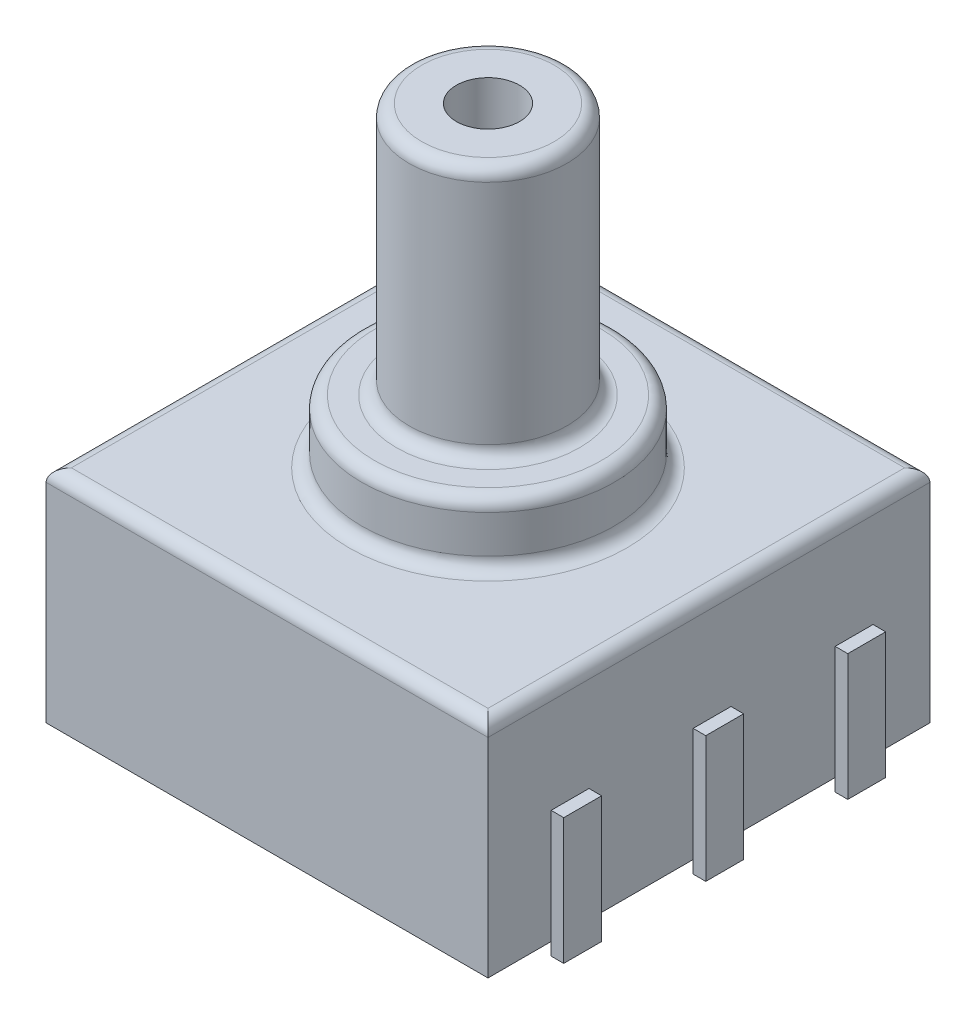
ISO-10303-21;
HEADER;
FILE_DESCRIPTION(('STEP AP214'),'2;1');
FILE_NAME('part.step','',(''),(''),'','','');
FILE_SCHEMA(('AUTOMOTIVE_DESIGN { 1 0 10303 214 1 1 1 1 }'));
ENDSEC;
DATA;
#1=APPLICATION_CONTEXT('core data for automotive mechanical design processes');
#2=APPLICATION_PROTOCOL_DEFINITION('international standard','automotive_design',2000,#1);
#3=PRODUCT_CONTEXT('',#1,'mechanical');
#4=PRODUCT('Part','Part','',(#3));
#5=PRODUCT_RELATED_PRODUCT_CATEGORY('part','',(#4));
#6=PRODUCT_DEFINITION_FORMATION('','',#4);
#7=PRODUCT_DEFINITION_CONTEXT('part definition',#1,'design');
#8=PRODUCT_DEFINITION('design','',#6,#7);
#9=PRODUCT_DEFINITION_SHAPE('','',#8);
#10=(LENGTH_UNIT() NAMED_UNIT(*) SI_UNIT(.MILLI.,.METRE.));
#11=(NAMED_UNIT(*) PLANE_ANGLE_UNIT() SI_UNIT($,.RADIAN.));
#12=(NAMED_UNIT(*) SI_UNIT($,.STERADIAN.) SOLID_ANGLE_UNIT());
#13=UNCERTAINTY_MEASURE_WITH_UNIT(LENGTH_MEASURE(1.E-05),#10,'distance_accuracy_value','');
#14=(GEOMETRIC_REPRESENTATION_CONTEXT(3) GLOBAL_UNCERTAINTY_ASSIGNED_CONTEXT((#13)) GLOBAL_UNIT_ASSIGNED_CONTEXT((#10,
#11,#12)) REPRESENTATION_CONTEXT('',''));
#15=CARTESIAN_POINT('',(0.,0.,0.));
#16=DIRECTION('',(0.,0.,1.));
#17=DIRECTION('',(1.,0.,0.));
#18=AXIS2_PLACEMENT_3D('',#15,#16,#17);
#19=CARTESIAN_POINT('',(3.5,3.5,-3.5));
#20=DIRECTION('',(-1.,0.,0.));
#21=DIRECTION('',(0.,0.,1.));
#22=AXIS2_PLACEMENT_3D('',#19,#20,#21);
#23=PLANE('',#22);
#24=DIRECTION('',(0.,-1.,0.));
#25=VECTOR('',#24,1.);
#26=CARTESIAN_POINT('',(3.5,1.8,-2.));
#27=LINE('',#26,#25);
#28=CARTESIAN_POINT('',(3.5,1.8,-2.));
#29=VERTEX_POINT('',#28);
#30=CARTESIAN_POINT('',(3.5,0.,-2.));
#31=VERTEX_POINT('',#30);
#32=EDGE_CURVE('E343',#29,#31,#27,.T.);
#33=ORIENTED_EDGE('',*,*,#32,.F.);
#34=DIRECTION('',(0.,0.,1.));
#35=VECTOR('',#34,1.);
#36=CARTESIAN_POINT('',(3.5,1.8,-2.));
#37=LINE('',#36,#35);
#38=CARTESIAN_POINT('',(3.5,1.8,-2.6));
#39=VERTEX_POINT('',#38);
#40=EDGE_CURVE('E352',#39,#29,#37,.T.);
#41=ORIENTED_EDGE('',*,*,#40,.F.);
#42=DIRECTION('',(0.,1.,0.));
#43=VECTOR('',#42,1.);
#44=CARTESIAN_POINT('',(3.5,1.8,-2.6));
#45=LINE('',#44,#43);
#46=CARTESIAN_POINT('',(3.5,0.,-2.6));
#47=VERTEX_POINT('',#46);
#48=EDGE_CURVE('E348',#47,#39,#45,.T.);
#49=ORIENTED_EDGE('',*,*,#48,.F.);
#50=DIRECTION('',(0.,0.,-1.));
#51=VECTOR('',#50,1.);
#52=CARTESIAN_POINT('',(3.5,0.,-3.5));
#53=LINE('',#52,#51);
#54=CARTESIAN_POINT('',(3.5,0.,-3.5));
#55=VERTEX_POINT('',#54);
#56=EDGE_CURVE('E508',#47,#55,#53,.T.);
#57=ORIENTED_EDGE('',*,*,#56,.T.);
#58=DIRECTION('',(0.,-1.,0.));
#59=VECTOR('',#58,1.);
#60=CARTESIAN_POINT('',(3.5,3.5,-3.5));
#61=LINE('',#60,#59);
#62=CARTESIAN_POINT('',(3.5,3.3,-3.5));
#63=VERTEX_POINT('',#62);
#64=EDGE_CURVE('E518',#63,#55,#61,.T.);
#65=ORIENTED_EDGE('',*,*,#64,.F.);
#66=DIRECTION('',(0.,0.,-1.));
#67=VECTOR('',#66,1.);
#68=CARTESIAN_POINT('',(3.50000000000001,3.3,3.5));
#69=LINE('',#68,#67);
#70=CARTESIAN_POINT('',(3.50000000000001,3.3,3.5));
#71=VERTEX_POINT('',#70);
#72=EDGE_CURVE('E544',#63,#71,#69,.F.);
#73=ORIENTED_EDGE('',*,*,#72,.T.);
#74=DIRECTION('',(0.,-1.,0.));
#75=VECTOR('',#74,1.);
#76=CARTESIAN_POINT('',(3.50000000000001,3.5,3.5));
#77=LINE('',#76,#75);
#78=CARTESIAN_POINT('',(3.50000000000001,0.,3.5));
#79=VERTEX_POINT('',#78);
#80=EDGE_CURVE('E521',#71,#79,#77,.T.);
#81=ORIENTED_EDGE('',*,*,#80,.T.);
#82=CARTESIAN_POINT('',(3.5,0.,2.5));
#83=VERTEX_POINT('',#82);
#84=EDGE_CURVE('E509',#79,#83,#53,.T.);
#85=ORIENTED_EDGE('',*,*,#84,.T.);
#86=DIRECTION('',(0.,-1.,0.));
#87=VECTOR('',#86,1.);
#88=CARTESIAN_POINT('',(3.5,1.8,2.5));
#89=LINE('',#88,#87);
#90=CARTESIAN_POINT('',(3.5,1.8,2.5));
#91=VERTEX_POINT('',#90);
#92=EDGE_CURVE('E447',#91,#83,#89,.T.);
#93=ORIENTED_EDGE('',*,*,#92,.F.);
#94=DIRECTION('',(0.,0.,1.));
#95=VECTOR('',#94,1.);
#96=CARTESIAN_POINT('',(3.5,1.8,2.5));
#97=LINE('',#96,#95);
#98=CARTESIAN_POINT('',(3.5,1.8,1.9));
#99=VERTEX_POINT('',#98);
#100=EDGE_CURVE('E456',#99,#91,#97,.T.);
#101=ORIENTED_EDGE('',*,*,#100,.F.);
#102=DIRECTION('',(0.,1.,0.));
#103=VECTOR('',#102,1.);
#104=CARTESIAN_POINT('',(3.5,1.8,1.9));
#105=LINE('',#104,#103);
#106=CARTESIAN_POINT('',(3.5,0.,1.9));
#107=VERTEX_POINT('',#106);
#108=EDGE_CURVE('E452',#107,#99,#105,.T.);
#109=ORIENTED_EDGE('',*,*,#108,.F.);
#110=CARTESIAN_POINT('',(3.5,0.,0.249999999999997));
#111=VERTEX_POINT('',#110);
#112=EDGE_CURVE('E1109',#107,#111,#53,.T.);
#113=ORIENTED_EDGE('',*,*,#112,.T.);
#114=DIRECTION('',(0.,-1.,0.));
#115=VECTOR('',#114,1.);
#116=CARTESIAN_POINT('',(3.5,1.8,0.249999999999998));
#117=LINE('',#116,#115);
#118=CARTESIAN_POINT('',(3.5,1.8,0.249999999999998));
#119=VERTEX_POINT('',#118);
#120=EDGE_CURVE('E377',#119,#111,#117,.T.);
#121=ORIENTED_EDGE('',*,*,#120,.F.);
#122=DIRECTION('',(0.,0.,1.));
#123=VECTOR('',#122,1.);
#124=CARTESIAN_POINT('',(3.5,1.8,0.249999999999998));
#125=LINE('',#124,#123);
#126=CARTESIAN_POINT('',(3.5,1.8,-0.350000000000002));
#127=VERTEX_POINT('',#126);
#128=EDGE_CURVE('E386',#127,#119,#125,.T.);
#129=ORIENTED_EDGE('',*,*,#128,.F.);
#130=DIRECTION('',(0.,1.,0.));
#131=VECTOR('',#130,1.);
#132=CARTESIAN_POINT('',(3.5,1.8,-0.350000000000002));
#133=LINE('',#132,#131);
#134=CARTESIAN_POINT('',(3.5,0.,-0.350000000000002));
#135=VERTEX_POINT('',#134);
#136=EDGE_CURVE('E382',#135,#127,#133,.T.);
#137=ORIENTED_EDGE('',*,*,#136,.F.);
#138=EDGE_CURVE('E1125',#135,#31,#53,.T.);
#139=ORIENTED_EDGE('',*,*,#138,.T.);
#140=EDGE_LOOP('',(#33,#41,#49,#57,#65,#73,#81,#85,#93,#101,#109,#113,#121,#129,#137,#139));
#141=FACE_BOUND('',#140,.T.);
#142=ADVANCED_FACE('F33',(#141),#23,.F.);
#143=CARTESIAN_POINT('',(-3.5,3.5,3.5));
#144=DIRECTION('',(0.,1.,0.));
#145=DIRECTION('',(0.,0.,1.));
#146=AXIS2_PLACEMENT_3D('',#143,#144,#145);
#147=PLANE('',#146);
#148=DIRECTION('',(0.,0.,-1.));
#149=VECTOR('',#148,1.);
#150=CARTESIAN_POINT('',(3.3,3.5,-3.5));
#151=LINE('',#150,#149);
#152=CARTESIAN_POINT('',(3.3,3.5,3.3));
#153=VERTEX_POINT('',#152);
#154=CARTESIAN_POINT('',(3.3,3.5,-3.3));
#155=VERTEX_POINT('',#154);
#156=EDGE_CURVE('E536',#153,#155,#151,.T.);
#157=ORIENTED_EDGE('',*,*,#156,.T.);
#158=DIRECTION('',(-1.,0.,0.));
#159=VECTOR('',#158,1.);
#160=CARTESIAN_POINT('',(-3.5,3.5,-3.3));
#161=LINE('',#160,#159);
#162=CARTESIAN_POINT('',(-3.3,3.5,-3.3));
#163=VERTEX_POINT('',#162);
#164=EDGE_CURVE('E538',#155,#163,#161,.T.);
#165=ORIENTED_EDGE('',*,*,#164,.T.);
#166=DIRECTION('',(0.,0.,1.));
#167=VECTOR('',#166,1.);
#168=CARTESIAN_POINT('',(-3.3,3.5,3.5));
#169=LINE('',#168,#167);
#170=CARTESIAN_POINT('',(-3.3,3.5,3.3));
#171=VERTEX_POINT('',#170);
#172=EDGE_CURVE('E532',#163,#171,#169,.T.);
#173=ORIENTED_EDGE('',*,*,#172,.T.);
#174=DIRECTION('',(1.,0.,0.));
#175=VECTOR('',#174,1.);
#176=CARTESIAN_POINT('',(3.50000000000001,3.5,3.3));
#177=LINE('',#176,#175);
#178=EDGE_CURVE('E534',#171,#153,#177,.T.);
#179=ORIENTED_EDGE('',*,*,#178,.T.);
#180=EDGE_LOOP('',(#157,#165,#173,#179));
#181=FACE_BOUND('',#180,.T.);
#182=CARTESIAN_POINT('',(0.,3.5,0.));
#183=DIRECTION('',(0.,1.,0.));
#184=DIRECTION('',(0.,0.,1.));
#185=AXIS2_PLACEMENT_3D('',#182,#183,#184);
#186=CIRCLE('',#185,2.2);
#187=CARTESIAN_POINT('',(0.,3.5,2.2));
#188=VERTEX_POINT('',#187);
#189=EDGE_CURVE('E529',#188,#188,#186,.F.);
#190=ORIENTED_EDGE('',*,*,#189,.T.);
#191=EDGE_LOOP('',(#190));
#192=FACE_BOUND('',#191,.T.);
#193=ADVANCED_FACE('F582',(#181,#192),#147,.T.);
#194=CARTESIAN_POINT('',(-3.5,3.5,-3.5));
#195=DIRECTION('',(1.,0.,0.));
#196=DIRECTION('',(0.,0.,-1.));
#197=AXIS2_PLACEMENT_3D('',#194,#195,#196);
#198=PLANE('',#197);
#199=DIRECTION('',(0.,0.,1.));
#200=VECTOR('',#199,1.);
#201=CARTESIAN_POINT('',(-3.50000000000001,1.8,-2.));
#202=LINE('',#201,#200);
#203=CARTESIAN_POINT('',(-3.5,1.8,-2.6));
#204=VERTEX_POINT('',#203);
#205=CARTESIAN_POINT('',(-3.5,1.8,-2.));
#206=VERTEX_POINT('',#205);
#207=EDGE_CURVE('E48',#204,#206,#202,.T.);
#208=ORIENTED_EDGE('',*,*,#207,.T.);
#209=DIRECTION('',(0.,-1.,0.));
#210=VECTOR('',#209,1.);
#211=CARTESIAN_POINT('',(-3.50000000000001,1.8,-2.));
#212=LINE('',#211,#210);
#213=CARTESIAN_POINT('',(-3.50000000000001,0.,-2.));
#214=VERTEX_POINT('',#213);
#215=EDGE_CURVE('E1085',#206,#214,#212,.T.);
#216=ORIENTED_EDGE('',*,*,#215,.T.);
#217=DIRECTION('',(0.,0.,1.));
#218=VECTOR('',#217,1.);
#219=CARTESIAN_POINT('',(-3.5,0.,-3.5));
#220=LINE('',#219,#218);
#221=CARTESIAN_POINT('',(-3.5,0.,-0.350000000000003));
#222=VERTEX_POINT('',#221);
#223=EDGE_CURVE('E504',#214,#222,#220,.T.);
#224=ORIENTED_EDGE('',*,*,#223,.T.);
#225=DIRECTION('',(0.,1.,0.));
#226=VECTOR('',#225,1.);
#227=CARTESIAN_POINT('',(-3.50000000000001,1.8,-0.350000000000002));
#228=LINE('',#227,#226);
#229=CARTESIAN_POINT('',(-3.5,1.8,-0.350000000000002));
#230=VERTEX_POINT('',#229);
#231=EDGE_CURVE('E312',#222,#230,#228,.T.);
#232=ORIENTED_EDGE('',*,*,#231,.T.);
#233=DIRECTION('',(0.,0.,1.));
#234=VECTOR('',#233,1.);
#235=CARTESIAN_POINT('',(-3.50000000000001,1.8,0.249999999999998));
#236=LINE('',#235,#234);
#237=CARTESIAN_POINT('',(-3.5,1.8,0.249999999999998));
#238=VERTEX_POINT('',#237);
#239=EDGE_CURVE('E310',#230,#238,#236,.T.);
#240=ORIENTED_EDGE('',*,*,#239,.T.);
#241=DIRECTION('',(0.,-1.,0.));
#242=VECTOR('',#241,1.);
#243=CARTESIAN_POINT('',(-3.50000000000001,1.8,0.249999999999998));
#244=LINE('',#243,#242);
#245=CARTESIAN_POINT('',(-3.50000000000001,0.,0.249999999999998));
#246=VERTEX_POINT('',#245);
#247=EDGE_CURVE('E307',#238,#246,#244,.T.);
#248=ORIENTED_EDGE('',*,*,#247,.T.);
#249=CARTESIAN_POINT('',(-3.5,0.,1.9));
#250=VERTEX_POINT('',#249);
#251=EDGE_CURVE('E1088',#246,#250,#220,.T.);
#252=ORIENTED_EDGE('',*,*,#251,.T.);
#253=DIRECTION('',(0.,1.,0.));
#254=VECTOR('',#253,1.);
#255=CARTESIAN_POINT('',(-3.5,1.8,1.9));
#256=LINE('',#255,#254);
#257=CARTESIAN_POINT('',(-3.5,1.8,1.9));
#258=VERTEX_POINT('',#257);
#259=EDGE_CURVE('E416',#250,#258,#256,.T.);
#260=ORIENTED_EDGE('',*,*,#259,.T.);
#261=DIRECTION('',(0.,0.,1.));
#262=VECTOR('',#261,1.);
#263=CARTESIAN_POINT('',(-3.5,1.8,2.5));
#264=LINE('',#263,#262);
#265=CARTESIAN_POINT('',(-3.5,1.8,2.5));
#266=VERTEX_POINT('',#265);
#267=EDGE_CURVE('E414',#258,#266,#264,.T.);
#268=ORIENTED_EDGE('',*,*,#267,.T.);
#269=DIRECTION('',(0.,-1.,0.));
#270=VECTOR('',#269,1.);
#271=CARTESIAN_POINT('',(-3.5,1.8,2.5));
#272=LINE('',#271,#270);
#273=CARTESIAN_POINT('',(-3.5,0.,2.5));
#274=VERTEX_POINT('',#273);
#275=EDGE_CURVE('E411',#266,#274,#272,.T.);
#276=ORIENTED_EDGE('',*,*,#275,.T.);
#277=CARTESIAN_POINT('',(-3.5,0.,3.5));
#278=VERTEX_POINT('',#277);
#279=EDGE_CURVE('E499',#274,#278,#220,.T.);
#280=ORIENTED_EDGE('',*,*,#279,.T.);
#281=DIRECTION('',(0.,-1.,0.));
#282=VECTOR('',#281,1.);
#283=CARTESIAN_POINT('',(-3.5,3.5,3.5));
#284=LINE('',#283,#282);
#285=CARTESIAN_POINT('',(-3.5,3.3,3.5));
#286=VERTEX_POINT('',#285);
#287=EDGE_CURVE('E523',#286,#278,#284,.T.);
#288=ORIENTED_EDGE('',*,*,#287,.F.);
#289=DIRECTION('',(0.,0.,1.));
#290=VECTOR('',#289,1.);
#291=CARTESIAN_POINT('',(-3.5,3.3,-3.5));
#292=LINE('',#291,#290);
#293=CARTESIAN_POINT('',(-3.5,3.3,-3.5));
#294=VERTEX_POINT('',#293);
#295=EDGE_CURVE('E548',#286,#294,#292,.F.);
#296=ORIENTED_EDGE('',*,*,#295,.T.);
#297=DIRECTION('',(0.,-1.,0.));
#298=VECTOR('',#297,1.);
#299=CARTESIAN_POINT('',(-3.5,3.5,-3.5));
#300=LINE('',#299,#298);
#301=CARTESIAN_POINT('',(-3.5,0.,-3.5));
#302=VERTEX_POINT('',#301);
#303=EDGE_CURVE('E516',#294,#302,#300,.T.);
#304=ORIENTED_EDGE('',*,*,#303,.T.);
#305=CARTESIAN_POINT('',(-3.5,0.,-2.6));
#306=VERTEX_POINT('',#305);
#307=EDGE_CURVE('E500',#302,#306,#220,.T.);
#308=ORIENTED_EDGE('',*,*,#307,.T.);
#309=DIRECTION('',(0.,1.,0.));
#310=VECTOR('',#309,1.);
#311=CARTESIAN_POINT('',(-3.50000000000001,1.8,-2.6));
#312=LINE('',#311,#310);
#313=EDGE_CURVE('E53',#306,#204,#312,.T.);
#314=ORIENTED_EDGE('',*,*,#313,.T.);
#315=EDGE_LOOP('',(#208,#216,#224,#232,#240,#248,#252,#260,#268,#276,#280,#288,#296,#304,#308,#314));
#316=FACE_BOUND('',#315,.T.);
#317=ADVANCED_FACE('F35',(#316),#198,.F.);
#318=CARTESIAN_POINT('',(-3.5,3.5,3.5));
#319=DIRECTION('',(0.,0.,-1.));
#320=DIRECTION('',(-1.,0.,0.));
#321=AXIS2_PLACEMENT_3D('',#318,#319,#320);
#322=PLANE('',#321);
#323=ORIENTED_EDGE('',*,*,#80,.F.);
#324=DIRECTION('',(1.,0.,0.));
#325=VECTOR('',#324,1.);
#326=CARTESIAN_POINT('',(-3.5,3.3,3.5));
#327=LINE('',#326,#325);
#328=EDGE_CURVE('E546',#71,#286,#327,.F.);
#329=ORIENTED_EDGE('',*,*,#328,.T.);
#330=ORIENTED_EDGE('',*,*,#287,.T.);
#331=DIRECTION('',(1.,0.,0.));
#332=VECTOR('',#331,1.);
#333=CARTESIAN_POINT('',(-3.5,0.,3.5));
#334=LINE('',#333,#332);
#335=EDGE_CURVE('E502',#278,#79,#334,.T.);
#336=ORIENTED_EDGE('',*,*,#335,.T.);
#337=EDGE_LOOP('',(#323,#329,#330,#336));
#338=FACE_BOUND('',#337,.T.);
#339=ADVANCED_FACE('F593',(#338),#322,.F.);
#340=CARTESIAN_POINT('',(-3.5,3.5,-3.5));
#341=DIRECTION('',(0.,0.,1.));
#342=DIRECTION('',(1.,0.,0.));
#343=AXIS2_PLACEMENT_3D('',#340,#341,#342);
#344=PLANE('',#343);
#345=ORIENTED_EDGE('',*,*,#303,.F.);
#346=DIRECTION('',(-1.,0.,0.));
#347=VECTOR('',#346,1.);
#348=CARTESIAN_POINT('',(3.5,3.3,-3.5));
#349=LINE('',#348,#347);
#350=EDGE_CURVE('E541',#294,#63,#349,.F.);
#351=ORIENTED_EDGE('',*,*,#350,.T.);
#352=ORIENTED_EDGE('',*,*,#64,.T.);
#353=DIRECTION('',(-1.,0.,0.));
#354=VECTOR('',#353,1.);
#355=CARTESIAN_POINT('',(-3.5,0.,-3.5));
#356=LINE('',#355,#354);
#357=EDGE_CURVE('E512',#55,#302,#356,.T.);
#358=ORIENTED_EDGE('',*,*,#357,.T.);
#359=EDGE_LOOP('',(#345,#351,#352,#358));
#360=FACE_BOUND('',#359,.T.);
#361=ADVANCED_FACE('F592',(#360),#344,.F.);
#362=CARTESIAN_POINT('',(-3.5,0.,3.5));
#363=DIRECTION('',(0.,1.,0.));
#364=DIRECTION('',(0.,0.,1.));
#365=AXIS2_PLACEMENT_3D('',#362,#363,#364);
#366=PLANE('',#365);
#367=ORIENTED_EDGE('',*,*,#307,.F.);
#368=ORIENTED_EDGE('',*,*,#357,.F.);
#369=ORIENTED_EDGE('',*,*,#56,.F.);
#370=EDGE_CURVE('E1127',#31,#47,#53,.T.);
#371=ORIENTED_EDGE('',*,*,#370,.F.);
#372=ORIENTED_EDGE('',*,*,#138,.F.);
#373=EDGE_CURVE('E1111',#111,#135,#53,.T.);
#374=ORIENTED_EDGE('',*,*,#373,.F.);
#375=ORIENTED_EDGE('',*,*,#112,.F.);
#376=EDGE_CURVE('E513',#83,#107,#53,.T.);
#377=ORIENTED_EDGE('',*,*,#376,.F.);
#378=ORIENTED_EDGE('',*,*,#84,.F.);
#379=ORIENTED_EDGE('',*,*,#335,.F.);
#380=ORIENTED_EDGE('',*,*,#279,.F.);
#381=EDGE_CURVE('E505',#250,#274,#220,.T.);
#382=ORIENTED_EDGE('',*,*,#381,.F.);
#383=ORIENTED_EDGE('',*,*,#251,.F.);
#384=EDGE_CURVE('E1089',#222,#246,#220,.T.);
#385=ORIENTED_EDGE('',*,*,#384,.F.);
#386=ORIENTED_EDGE('',*,*,#223,.F.);
#387=EDGE_CURVE('E503',#306,#214,#220,.T.);
#388=ORIENTED_EDGE('',*,*,#387,.F.);
#389=EDGE_LOOP('',(#367,#368,#369,#371,#372,#374,#375,#377,#378,#379,#380,#382,#383,#385,#386,#388));
#390=FACE_BOUND('',#389,.T.);
#391=ADVANCED_FACE('F600',(#390),#366,.F.);
#392=CARTESIAN_POINT('',(0.,7.02888399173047,0.));
#393=DIRECTION('',(0.,1.,0.));
#394=DIRECTION('',(0.,0.,1.));
#395=AXIS2_PLACEMENT_3D('',#392,#393,#394);
#396=CYLINDRICAL_SURFACE('',#395,2.);
#397=CARTESIAN_POINT('',(0.,3.7,0.));
#398=DIRECTION('',(0.,1.,0.));
#399=DIRECTION('',(0.,0.,1.));
#400=AXIS2_PLACEMENT_3D('',#397,#398,#399);
#401=CIRCLE('',#400,2.);
#402=CARTESIAN_POINT('',(0.,3.7,2.));
#403=VERTEX_POINT('',#402);
#404=EDGE_CURVE('E553',#403,#403,#401,.T.);
#405=ORIENTED_EDGE('',*,*,#404,.T.);
#406=EDGE_LOOP('',(#405));
#407=FACE_BOUND('',#406,.T.);
#408=CARTESIAN_POINT('',(0.,4.3,0.));
#409=DIRECTION('',(0.,1.,0.));
#410=DIRECTION('',(0.,0.,1.));
#411=AXIS2_PLACEMENT_3D('',#408,#409,#410);
#412=CIRCLE('',#411,2.);
#413=CARTESIAN_POINT('',(0.,4.3,2.));
#414=VERTEX_POINT('',#413);
#415=EDGE_CURVE('E550',#414,#414,#412,.F.);
#416=ORIENTED_EDGE('',*,*,#415,.T.);
#417=EDGE_LOOP('',(#416));
#418=FACE_BOUND('',#417,.T.);
#419=ADVANCED_FACE('F663',(#407,#418),#396,.T.);
#420=CARTESIAN_POINT('',(0.,4.5,2.));
#421=DIRECTION('',(0.,1.,0.));
#422=DIRECTION('',(0.,0.,1.));
#423=AXIS2_PLACEMENT_3D('',#420,#421,#422);
#424=PLANE('',#423);
#425=CARTESIAN_POINT('',(0.,4.5,0.));
#426=DIRECTION('',(0.,1.,0.));
#427=DIRECTION('',(0.,0.,1.));
#428=AXIS2_PLACEMENT_3D('',#425,#426,#427);
#429=CIRCLE('',#428,1.45);
#430=CARTESIAN_POINT('',(0.,4.5,1.45));
#431=VERTEX_POINT('',#430);
#432=EDGE_CURVE('E11',#431,#431,#429,.F.);
#433=ORIENTED_EDGE('',*,*,#432,.T.);
#434=EDGE_LOOP('',(#433));
#435=FACE_BOUND('',#434,.T.);
#436=CARTESIAN_POINT('',(0.,4.5,0.));
#437=DIRECTION('',(0.,1.,0.));
#438=DIRECTION('',(0.,0.,1.));
#439=AXIS2_PLACEMENT_3D('',#436,#437,#438);
#440=CIRCLE('',#439,1.8);
#441=CARTESIAN_POINT('',(0.,4.5,1.8));
#442=VERTEX_POINT('',#441);
#443=EDGE_CURVE('E41',#442,#442,#440,.T.);
#444=ORIENTED_EDGE('',*,*,#443,.T.);
#445=EDGE_LOOP('',(#444));
#446=FACE_BOUND('',#445,.T.);
#447=ADVANCED_FACE('F561',(#435,#446),#424,.T.);
#448=CARTESIAN_POINT('',(0.,7.02888399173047,0.));
#449=DIRECTION('',(0.,1.,0.));
#450=DIRECTION('',(0.,0.,1.));
#451=AXIS2_PLACEMENT_3D('',#448,#449,#450);
#452=CYLINDRICAL_SURFACE('',#451,1.25);
#453=CARTESIAN_POINT('',(0.,4.7,0.));
#454=DIRECTION('',(0.,1.,0.));
#455=DIRECTION('',(0.,0.,1.));
#456=AXIS2_PLACEMENT_3D('',#453,#454,#455);
#457=CIRCLE('',#456,1.25);
#458=CARTESIAN_POINT('',(0.,4.7,1.25));
#459=VERTEX_POINT('',#458);
#460=EDGE_CURVE('E556',#459,#459,#457,.T.);
#461=ORIENTED_EDGE('',*,*,#460,.T.);
#462=EDGE_LOOP('',(#461));
#463=FACE_BOUND('',#462,.T.);
#464=CARTESIAN_POINT('',(0.,8.3,0.));
#465=DIRECTION('',(0.,1.,0.));
#466=DIRECTION('',(0.,0.,1.));
#467=AXIS2_PLACEMENT_3D('',#464,#465,#466);
#468=CIRCLE('',#467,1.25);
#469=CARTESIAN_POINT('',(0.,8.3,1.25));
#470=VERTEX_POINT('',#469);
#471=EDGE_CURVE('E496',#470,#470,#468,.T.);
#472=ORIENTED_EDGE('',*,*,#471,.F.);
#473=EDGE_LOOP('',(#472));
#474=FACE_BOUND('',#473,.T.);
#475=ADVANCED_FACE('F656',(#463,#474),#452,.T.);
#476=CARTESIAN_POINT('',(0.,8.3,0.));
#477=DIRECTION('',(0.,1.,0.));
#478=DIRECTION('',(0.,0.,1.));
#479=AXIS2_PLACEMENT_3D('',#476,#477,#478);
#480=TOROIDAL_SURFACE('',#479,1.05,0.200000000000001);
#481=ORIENTED_EDGE('',*,*,#471,.T.);
#482=EDGE_LOOP('',(#481));
#483=FACE_BOUND('',#482,.T.);
#484=CARTESIAN_POINT('',(0.,8.5,0.));
#485=DIRECTION('',(0.,1.,0.));
#486=DIRECTION('',(0.,0.,1.));
#487=AXIS2_PLACEMENT_3D('',#484,#485,#486);
#488=CIRCLE('',#487,1.05);
#489=CARTESIAN_POINT('',(0.,8.5,1.05));
#490=VERTEX_POINT('',#489);
#491=EDGE_CURVE('E493',#490,#490,#488,.T.);
#492=ORIENTED_EDGE('',*,*,#491,.F.);
#493=EDGE_LOOP('',(#492));
#494=FACE_BOUND('',#493,.T.);
#495=ADVANCED_FACE('F652',(#483,#494),#480,.T.);
#496=CARTESIAN_POINT('',(0.,8.5,1.05));
#497=DIRECTION('',(0.,1.,0.));
#498=DIRECTION('',(0.,0.,1.));
#499=AXIS2_PLACEMENT_3D('',#496,#497,#498);
#500=PLANE('',#499);
#501=ORIENTED_EDGE('',*,*,#491,.T.);
#502=EDGE_LOOP('',(#501));
#503=FACE_BOUND('',#502,.T.);
#504=CARTESIAN_POINT('',(0.,8.5,0.));
#505=DIRECTION('',(0.,1.,0.));
#506=DIRECTION('',(0.,0.,1.));
#507=AXIS2_PLACEMENT_3D('',#504,#505,#506);
#508=CIRCLE('',#507,0.5);
#509=CARTESIAN_POINT('',(0.,8.5,0.5));
#510=VERTEX_POINT('',#509);
#511=EDGE_CURVE('E490',#510,#510,#508,.T.);
#512=ORIENTED_EDGE('',*,*,#511,.F.);
#513=EDGE_LOOP('',(#512));
#514=FACE_BOUND('',#513,.T.);
#515=ADVANCED_FACE('F648',(#503,#514),#500,.T.);
#516=CARTESIAN_POINT('',(0.,7.02888399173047,0.));
#517=DIRECTION('',(0.,1.,0.));
#518=DIRECTION('',(0.,0.,1.));
#519=AXIS2_PLACEMENT_3D('',#516,#517,#518);
#520=CYLINDRICAL_SURFACE('',#519,0.5);
#521=ORIENTED_EDGE('',*,*,#511,.T.);
#522=EDGE_LOOP('',(#521));
#523=FACE_BOUND('',#522,.T.);
#524=CARTESIAN_POINT('',(0.,3.5,0.));
#525=DIRECTION('',(0.,1.,0.));
#526=DIRECTION('',(0.,0.,1.));
#527=AXIS2_PLACEMENT_3D('',#524,#525,#526);
#528=CIRCLE('',#527,0.5);
#529=CARTESIAN_POINT('',(0.,3.5,0.5));
#530=VERTEX_POINT('',#529);
#531=EDGE_CURVE('E526',#530,#530,#528,.F.);
#532=ORIENTED_EDGE('',*,*,#531,.T.);
#533=EDGE_LOOP('',(#532));
#534=FACE_BOUND('',#533,.T.);
#535=ADVANCED_FACE('F645',(#523,#534),#520,.F.);
#536=ORIENTED_EDGE('',*,*,#531,.F.);
#537=EDGE_LOOP('',(#536));
#538=FACE_BOUND('',#537,.T.);
#539=ADVANCED_FACE('F590',(#538),#147,.T.);
#540=CARTESIAN_POINT('',(-3.5,3.3,3.3));
#541=DIRECTION('',(-1.,0.,0.));
#542=DIRECTION('',(0.,0.,1.));
#543=AXIS2_PLACEMENT_3D('',#540,#541,#542);
#544=CYLINDRICAL_SURFACE('',#543,0.2);
#545=CARTESIAN_POINT('',(-3.3,3.3,3.3));
#546=DIRECTION('',(-0.707106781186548,0.,-0.707106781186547));
#547=DIRECTION('',(0.707106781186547,0.,-0.707106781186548));
#548=AXIS2_PLACEMENT_3D('',#545,#546,#547);
#549=ELLIPSE('',#548,0.282842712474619,0.2);
#550=EDGE_CURVE('E484',#286,#171,#549,.T.);
#551=ORIENTED_EDGE('',*,*,#550,.F.);
#552=ORIENTED_EDGE('',*,*,#328,.F.);
#553=CARTESIAN_POINT('',(3.3,3.3,3.3));
#554=DIRECTION('',(-0.707106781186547,0.,0.707106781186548));
#555=DIRECTION('',(-0.707106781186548,0.,-0.707106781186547));
#556=AXIS2_PLACEMENT_3D('',#553,#554,#555);
#557=ELLIPSE('',#556,0.282842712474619,0.2);
#558=EDGE_CURVE('E487',#153,#71,#557,.F.);
#559=ORIENTED_EDGE('',*,*,#558,.F.);
#560=ORIENTED_EDGE('',*,*,#178,.F.);
#561=EDGE_LOOP('',(#551,#552,#559,#560));
#562=FACE_BOUND('',#561,.T.);
#563=ADVANCED_FACE('F610',(#562),#544,.T.);
#564=CARTESIAN_POINT('',(3.3,3.3,3.5));
#565=DIRECTION('',(0.,0.,1.));
#566=DIRECTION('',(1.,0.,0.));
#567=AXIS2_PLACEMENT_3D('',#564,#565,#566);
#568=CYLINDRICAL_SURFACE('',#567,0.2);
#569=ORIENTED_EDGE('',*,*,#558,.T.);
#570=ORIENTED_EDGE('',*,*,#72,.F.);
#571=CARTESIAN_POINT('',(3.3,3.3,-3.3));
#572=DIRECTION('',(0.707106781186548,0.,0.707106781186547));
#573=DIRECTION('',(-0.707106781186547,0.,0.707106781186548));
#574=AXIS2_PLACEMENT_3D('',#571,#572,#573);
#575=ELLIPSE('',#574,0.282842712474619,0.2);
#576=EDGE_CURVE('E482',#155,#63,#575,.F.);
#577=ORIENTED_EDGE('',*,*,#576,.F.);
#578=ORIENTED_EDGE('',*,*,#156,.F.);
#579=EDGE_LOOP('',(#569,#570,#577,#578));
#580=FACE_BOUND('',#579,.T.);
#581=ADVANCED_FACE('F616',(#580),#568,.T.);
#582=CARTESIAN_POINT('',(-3.3,3.3,3.5));
#583=DIRECTION('',(0.,0.,-1.));
#584=DIRECTION('',(-1.,0.,0.));
#585=AXIS2_PLACEMENT_3D('',#582,#583,#584);
#586=CYLINDRICAL_SURFACE('',#585,0.2);
#587=ORIENTED_EDGE('',*,*,#550,.T.);
#588=ORIENTED_EDGE('',*,*,#172,.F.);
#589=CARTESIAN_POINT('',(-3.3,3.3,-3.3));
#590=DIRECTION('',(0.707106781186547,0.,-0.707106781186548));
#591=DIRECTION('',(-0.707106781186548,0.,-0.707106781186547));
#592=AXIS2_PLACEMENT_3D('',#589,#590,#591);
#593=ELLIPSE('',#592,0.282842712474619,0.2);
#594=EDGE_CURVE('E480',#294,#163,#593,.T.);
#595=ORIENTED_EDGE('',*,*,#594,.F.);
#596=ORIENTED_EDGE('',*,*,#295,.F.);
#597=EDGE_LOOP('',(#587,#588,#595,#596));
#598=FACE_BOUND('',#597,.T.);
#599=ADVANCED_FACE('F622',(#598),#586,.T.);
#600=CARTESIAN_POINT('',(-3.5,3.3,-3.3));
#601=DIRECTION('',(1.,0.,0.));
#602=DIRECTION('',(0.,0.,-1.));
#603=AXIS2_PLACEMENT_3D('',#600,#601,#602);
#604=CYLINDRICAL_SURFACE('',#603,0.2);
#605=ORIENTED_EDGE('',*,*,#576,.T.);
#606=ORIENTED_EDGE('',*,*,#350,.F.);
#607=ORIENTED_EDGE('',*,*,#594,.T.);
#608=ORIENTED_EDGE('',*,*,#164,.F.);
#609=EDGE_LOOP('',(#605,#606,#607,#608));
#610=FACE_BOUND('',#609,.T.);
#611=ADVANCED_FACE('F630',(#610),#604,.T.);
#612=CARTESIAN_POINT('',(0.,3.7,0.));
#613=DIRECTION('',(0.,1.,0.));
#614=DIRECTION('',(0.,0.,1.));
#615=AXIS2_PLACEMENT_3D('',#612,#613,#614);
#616=TOROIDAL_SURFACE('',#615,2.2,0.2);
#617=ORIENTED_EDGE('',*,*,#189,.F.);
#618=EDGE_LOOP('',(#617));
#619=FACE_BOUND('',#618,.T.);
#620=ORIENTED_EDGE('',*,*,#404,.F.);
#621=EDGE_LOOP('',(#620));
#622=FACE_BOUND('',#621,.T.);
#623=ADVANCED_FACE('F576',(#619,#622),#616,.F.);
#624=CARTESIAN_POINT('',(0.,4.7,0.));
#625=DIRECTION('',(0.,1.,0.));
#626=DIRECTION('',(0.,0.,1.));
#627=AXIS2_PLACEMENT_3D('',#624,#625,#626);
#628=TOROIDAL_SURFACE('',#627,1.45,0.2);
#629=ORIENTED_EDGE('',*,*,#432,.F.);
#630=EDGE_LOOP('',(#629));
#631=FACE_BOUND('',#630,.T.);
#632=ORIENTED_EDGE('',*,*,#460,.F.);
#633=EDGE_LOOP('',(#632));
#634=FACE_BOUND('',#633,.T.);
#635=ADVANCED_FACE('F566',(#631,#634),#628,.F.);
#636=CARTESIAN_POINT('',(0.,4.3,0.));
#637=DIRECTION('',(0.,1.,0.));
#638=DIRECTION('',(0.,0.,1.));
#639=AXIS2_PLACEMENT_3D('',#636,#637,#638);
#640=TOROIDAL_SURFACE('',#639,1.8,0.2);
#641=ORIENTED_EDGE('',*,*,#415,.F.);
#642=EDGE_LOOP('',(#641));
#643=FACE_BOUND('',#642,.T.);
#644=ORIENTED_EDGE('',*,*,#443,.F.);
#645=EDGE_LOOP('',(#644));
#646=FACE_BOUND('',#645,.T.);
#647=ADVANCED_FACE('F563',(#643,#646),#640,.T.);
#648=CARTESIAN_POINT('',(3.5,-0.2,2.5));
#649=DIRECTION('',(1.,0.,0.));
#650=DIRECTION('',(0.,0.,-1.));
#651=AXIS2_PLACEMENT_3D('',#648,#649,#650);
#652=PLANE('',#651);
#653=CARTESIAN_POINT('',(3.5,-0.2,2.5));
#654=VERTEX_POINT('',#653);
#655=EDGE_CURVE('E446',#83,#654,#89,.T.);
#656=ORIENTED_EDGE('',*,*,#655,.F.);
#657=ORIENTED_EDGE('',*,*,#376,.T.);
#658=CARTESIAN_POINT('',(3.5,-0.2,1.9));
#659=VERTEX_POINT('',#658);
#660=EDGE_CURVE('E453',#659,#107,#105,.T.);
#661=ORIENTED_EDGE('',*,*,#660,.F.);
#662=DIRECTION('',(0.,0.,-1.));
#663=VECTOR('',#662,1.);
#664=CARTESIAN_POINT('',(3.5,-0.2,2.5));
#665=LINE('',#664,#663);
#666=EDGE_CURVE('E450',#654,#659,#665,.T.);
#667=ORIENTED_EDGE('',*,*,#666,.F.);
#668=EDGE_LOOP('',(#656,#657,#661,#667));
#669=FACE_BOUND('',#668,.T.);
#670=ADVANCED_FACE('F565',(#669),#652,.F.);
#671=CARTESIAN_POINT('',(3.70000000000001,1.8,2.5));
#672=DIRECTION('',(0.,0.,-1.));
#673=DIRECTION('',(-1.,0.,0.));
#674=AXIS2_PLACEMENT_3D('',#671,#672,#673);
#675=PLANE('',#674);
#676=ORIENTED_EDGE('',*,*,#92,.T.);
#677=ORIENTED_EDGE('',*,*,#655,.T.);
#678=DIRECTION('',(-1.,0.,0.));
#679=VECTOR('',#678,1.);
#680=CARTESIAN_POINT('',(3.70000000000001,-0.2,2.5));
#681=LINE('',#680,#679);
#682=CARTESIAN_POINT('',(3.70000000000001,-0.2,2.5));
#683=VERTEX_POINT('',#682);
#684=EDGE_CURVE('E477',#683,#654,#681,.T.);
#685=ORIENTED_EDGE('',*,*,#684,.F.);
#686=DIRECTION('',(0.,-1.,0.));
#687=VECTOR('',#686,1.);
#688=CARTESIAN_POINT('',(3.70000000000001,1.8,2.5));
#689=LINE('',#688,#687);
#690=CARTESIAN_POINT('',(3.70000000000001,1.8,2.5));
#691=VERTEX_POINT('',#690);
#692=EDGE_CURVE('E459',#691,#683,#689,.T.);
#693=ORIENTED_EDGE('',*,*,#692,.F.);
#694=DIRECTION('',(-1.,0.,0.));
#695=VECTOR('',#694,1.);
#696=CARTESIAN_POINT('',(3.70000000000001,1.8,2.5));
#697=LINE('',#696,#695);
#698=EDGE_CURVE('E468',#691,#91,#697,.T.);
#699=ORIENTED_EDGE('',*,*,#698,.T.);
#700=EDGE_LOOP('',(#676,#677,#685,#693,#699));
#701=FACE_BOUND('',#700,.T.);
#702=ADVANCED_FACE('F573',(#701),#675,.F.);
#703=CARTESIAN_POINT('',(3.70000000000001,-0.2,2.5));
#704=DIRECTION('',(0.,1.,0.));
#705=DIRECTION('',(0.,0.,1.));
#706=AXIS2_PLACEMENT_3D('',#703,#704,#705);
#707=PLANE('',#706);
#708=ORIENTED_EDGE('',*,*,#666,.T.);
#709=DIRECTION('',(-1.,0.,0.));
#710=VECTOR('',#709,1.);
#711=CARTESIAN_POINT('',(3.70000000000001,-0.2,1.9));
#712=LINE('',#711,#710);
#713=CARTESIAN_POINT('',(3.70000000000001,-0.2,1.9));
#714=VERTEX_POINT('',#713);
#715=EDGE_CURVE('E474',#714,#659,#712,.T.);
#716=ORIENTED_EDGE('',*,*,#715,.F.);
#717=DIRECTION('',(0.,0.,-1.));
#718=VECTOR('',#717,1.);
#719=CARTESIAN_POINT('',(3.70000000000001,-0.2,2.5));
#720=LINE('',#719,#718);
#721=EDGE_CURVE('E462',#683,#714,#720,.T.);
#722=ORIENTED_EDGE('',*,*,#721,.F.);
#723=ORIENTED_EDGE('',*,*,#684,.T.);
#724=EDGE_LOOP('',(#708,#716,#722,#723));
#725=FACE_BOUND('',#724,.T.);
#726=ADVANCED_FACE('F727',(#725),#707,.F.);
#727=CARTESIAN_POINT('',(3.70000000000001,1.8,1.9));
#728=DIRECTION('',(0.,0.,1.));
#729=DIRECTION('',(1.,0.,0.));
#730=AXIS2_PLACEMENT_3D('',#727,#728,#729);
#731=PLANE('',#730);
#732=ORIENTED_EDGE('',*,*,#660,.T.);
#733=ORIENTED_EDGE('',*,*,#108,.T.);
#734=DIRECTION('',(-1.,0.,0.));
#735=VECTOR('',#734,1.);
#736=CARTESIAN_POINT('',(3.70000000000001,1.8,1.9));
#737=LINE('',#736,#735);
#738=CARTESIAN_POINT('',(3.70000000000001,1.8,1.9));
#739=VERTEX_POINT('',#738);
#740=EDGE_CURVE('E471',#739,#99,#737,.T.);
#741=ORIENTED_EDGE('',*,*,#740,.F.);
#742=DIRECTION('',(0.,1.,0.));
#743=VECTOR('',#742,1.);
#744=CARTESIAN_POINT('',(3.70000000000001,1.8,1.9));
#745=LINE('',#744,#743);
#746=EDGE_CURVE('E464',#714,#739,#745,.T.);
#747=ORIENTED_EDGE('',*,*,#746,.F.);
#748=ORIENTED_EDGE('',*,*,#715,.T.);
#749=EDGE_LOOP('',(#732,#733,#741,#747,#748));
#750=FACE_BOUND('',#749,.T.);
#751=ADVANCED_FACE('F736',(#750),#731,.F.);
#752=CARTESIAN_POINT('',(3.70000000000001,1.8,2.5));
#753=DIRECTION('',(0.,-1.,0.));
#754=DIRECTION('',(0.,0.,-1.));
#755=AXIS2_PLACEMENT_3D('',#752,#753,#754);
#756=PLANE('',#755);
#757=ORIENTED_EDGE('',*,*,#100,.T.);
#758=ORIENTED_EDGE('',*,*,#698,.F.);
#759=DIRECTION('',(0.,0.,1.));
#760=VECTOR('',#759,1.);
#761=CARTESIAN_POINT('',(3.70000000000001,1.8,2.5));
#762=LINE('',#761,#760);
#763=EDGE_CURVE('E466',#739,#691,#762,.T.);
#764=ORIENTED_EDGE('',*,*,#763,.F.);
#765=ORIENTED_EDGE('',*,*,#740,.T.);
#766=EDGE_LOOP('',(#757,#758,#764,#765));
#767=FACE_BOUND('',#766,.T.);
#768=ADVANCED_FACE('F746',(#767),#756,.F.);
#769=CARTESIAN_POINT('',(3.70000000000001,-0.2,2.5));
#770=DIRECTION('',(1.,0.,0.));
#771=DIRECTION('',(0.,0.,-1.));
#772=AXIS2_PLACEMENT_3D('',#769,#770,#771);
#773=PLANE('',#772);
#774=ORIENTED_EDGE('',*,*,#692,.T.);
#775=ORIENTED_EDGE('',*,*,#721,.T.);
#776=ORIENTED_EDGE('',*,*,#746,.T.);
#777=ORIENTED_EDGE('',*,*,#763,.T.);
#778=EDGE_LOOP('',(#774,#775,#776,#777));
#779=FACE_BOUND('',#778,.T.);
#780=ADVANCED_FACE('F756',(#779),#773,.T.);
#781=CARTESIAN_POINT('',(-3.5,-0.2,2.5));
#782=DIRECTION('',(-1.,0.,0.));
#783=DIRECTION('',(0.,0.,-1.));
#784=AXIS2_PLACEMENT_3D('',#781,#782,#783);
#785=PLANE('',#784);
#786=CARTESIAN_POINT('',(-3.5,-0.2,1.9));
#787=VERTEX_POINT('',#786);
#788=EDGE_CURVE('E417',#787,#250,#256,.T.);
#789=ORIENTED_EDGE('',*,*,#788,.T.);
#790=ORIENTED_EDGE('',*,*,#381,.T.);
#791=CARTESIAN_POINT('',(-3.5,-0.2,2.5));
#792=VERTEX_POINT('',#791);
#793=EDGE_CURVE('E410',#274,#792,#272,.T.);
#794=ORIENTED_EDGE('',*,*,#793,.T.);
#795=DIRECTION('',(0.,0.,-1.));
#796=VECTOR('',#795,1.);
#797=CARTESIAN_POINT('',(-3.5,-0.2,2.5));
#798=LINE('',#797,#796);
#799=EDGE_CURVE('E420',#792,#787,#798,.T.);
#800=ORIENTED_EDGE('',*,*,#799,.T.);
#801=EDGE_LOOP('',(#789,#790,#794,#800));
#802=FACE_BOUND('',#801,.T.);
#803=ADVANCED_FACE('F766',(#802),#785,.F.);
#804=CARTESIAN_POINT('',(-3.70000000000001,1.8,2.5));
#805=DIRECTION('',(0.,0.,1.));
#806=DIRECTION('',(1.,0.,0.));
#807=AXIS2_PLACEMENT_3D('',#804,#805,#806);
#808=PLANE('',#807);
#809=ORIENTED_EDGE('',*,*,#275,.F.);
#810=DIRECTION('',(1.,0.,0.));
#811=VECTOR('',#810,1.);
#812=CARTESIAN_POINT('',(-3.70000000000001,1.8,2.5));
#813=LINE('',#812,#811);
#814=CARTESIAN_POINT('',(-3.70000000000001,1.8,2.5));
#815=VERTEX_POINT('',#814);
#816=EDGE_CURVE('E443',#815,#266,#813,.T.);
#817=ORIENTED_EDGE('',*,*,#816,.F.);
#818=DIRECTION('',(0.,-1.,0.));
#819=VECTOR('',#818,1.);
#820=CARTESIAN_POINT('',(-3.70000000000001,1.8,2.5));
#821=LINE('',#820,#819);
#822=CARTESIAN_POINT('',(-3.70000000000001,-0.2,2.5));
#823=VERTEX_POINT('',#822);
#824=EDGE_CURVE('E423',#815,#823,#821,.T.);
#825=ORIENTED_EDGE('',*,*,#824,.T.);
#826=DIRECTION('',(1.,0.,0.));
#827=VECTOR('',#826,1.);
#828=CARTESIAN_POINT('',(-3.70000000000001,-0.2,2.5));
#829=LINE('',#828,#827);
#830=EDGE_CURVE('E435',#823,#792,#829,.T.);
#831=ORIENTED_EDGE('',*,*,#830,.T.);
#832=ORIENTED_EDGE('',*,*,#793,.F.);
#833=EDGE_LOOP('',(#809,#817,#825,#831,#832));
#834=FACE_BOUND('',#833,.T.);
#835=ADVANCED_FACE('F776',(#834),#808,.T.);
#836=CARTESIAN_POINT('',(-3.70000000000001,1.8,2.5));
#837=DIRECTION('',(0.,1.,0.));
#838=DIRECTION('',(0.,0.,1.));
#839=AXIS2_PLACEMENT_3D('',#836,#837,#838);
#840=PLANE('',#839);
#841=ORIENTED_EDGE('',*,*,#267,.F.);
#842=DIRECTION('',(1.,0.,0.));
#843=VECTOR('',#842,1.);
#844=CARTESIAN_POINT('',(-3.70000000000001,1.8,1.9));
#845=LINE('',#844,#843);
#846=CARTESIAN_POINT('',(-3.70000000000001,1.8,1.9));
#847=VERTEX_POINT('',#846);
#848=EDGE_CURVE('E440',#847,#258,#845,.T.);
#849=ORIENTED_EDGE('',*,*,#848,.F.);
#850=DIRECTION('',(0.,0.,1.));
#851=VECTOR('',#850,1.);
#852=CARTESIAN_POINT('',(-3.70000000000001,1.8,2.5));
#853=LINE('',#852,#851);
#854=EDGE_CURVE('E426',#847,#815,#853,.T.);
#855=ORIENTED_EDGE('',*,*,#854,.T.);
#856=ORIENTED_EDGE('',*,*,#816,.T.);
#857=EDGE_LOOP('',(#841,#849,#855,#856));
#858=FACE_BOUND('',#857,.T.);
#859=ADVANCED_FACE('F786',(#858),#840,.T.);
#860=CARTESIAN_POINT('',(-3.70000000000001,1.8,1.9));
#861=DIRECTION('',(0.,0.,-1.));
#862=DIRECTION('',(-1.,0.,0.));
#863=AXIS2_PLACEMENT_3D('',#860,#861,#862);
#864=PLANE('',#863);
#865=ORIENTED_EDGE('',*,*,#788,.F.);
#866=DIRECTION('',(1.,0.,0.));
#867=VECTOR('',#866,1.);
#868=CARTESIAN_POINT('',(-3.70000000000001,-0.2,1.9));
#869=LINE('',#868,#867);
#870=CARTESIAN_POINT('',(-3.70000000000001,-0.2,1.9));
#871=VERTEX_POINT('',#870);
#872=EDGE_CURVE('E438',#871,#787,#869,.T.);
#873=ORIENTED_EDGE('',*,*,#872,.F.);
#874=DIRECTION('',(0.,1.,0.));
#875=VECTOR('',#874,1.);
#876=CARTESIAN_POINT('',(-3.70000000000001,1.8,1.9));
#877=LINE('',#876,#875);
#878=EDGE_CURVE('E429',#871,#847,#877,.T.);
#879=ORIENTED_EDGE('',*,*,#878,.T.);
#880=ORIENTED_EDGE('',*,*,#848,.T.);
#881=ORIENTED_EDGE('',*,*,#259,.F.);
#882=EDGE_LOOP('',(#865,#873,#879,#880,#881));
#883=FACE_BOUND('',#882,.T.);
#884=ADVANCED_FACE('F796',(#883),#864,.T.);
#885=CARTESIAN_POINT('',(-3.70000000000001,-0.2,2.5));
#886=DIRECTION('',(0.,-1.,0.));
#887=DIRECTION('',(0.,0.,-1.));
#888=AXIS2_PLACEMENT_3D('',#885,#886,#887);
#889=PLANE('',#888);
#890=ORIENTED_EDGE('',*,*,#799,.F.);
#891=ORIENTED_EDGE('',*,*,#830,.F.);
#892=DIRECTION('',(0.,0.,-1.));
#893=VECTOR('',#892,1.);
#894=CARTESIAN_POINT('',(-3.70000000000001,-0.2,2.5));
#895=LINE('',#894,#893);
#896=EDGE_CURVE('E432',#823,#871,#895,.T.);
#897=ORIENTED_EDGE('',*,*,#896,.T.);
#898=ORIENTED_EDGE('',*,*,#872,.T.);
#899=EDGE_LOOP('',(#890,#891,#897,#898));
#900=FACE_BOUND('',#899,.T.);
#901=ADVANCED_FACE('F806',(#900),#889,.T.);
#902=CARTESIAN_POINT('',(-3.70000000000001,-0.2,2.5));
#903=DIRECTION('',(-1.,0.,0.));
#904=DIRECTION('',(0.,0.,-1.));
#905=AXIS2_PLACEMENT_3D('',#902,#903,#904);
#906=PLANE('',#905);
#907=ORIENTED_EDGE('',*,*,#824,.F.);
#908=ORIENTED_EDGE('',*,*,#854,.F.);
#909=ORIENTED_EDGE('',*,*,#878,.F.);
#910=ORIENTED_EDGE('',*,*,#896,.F.);
#911=EDGE_LOOP('',(#907,#908,#909,#910));
#912=FACE_BOUND('',#911,.T.);
#913=ADVANCED_FACE('F816',(#912),#906,.T.);
#914=CARTESIAN_POINT('',(3.5,-0.2,0.249999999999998));
#915=DIRECTION('',(1.,0.,0.));
#916=DIRECTION('',(0.,0.,-1.));
#917=AXIS2_PLACEMENT_3D('',#914,#915,#916);
#918=PLANE('',#917);
#919=CARTESIAN_POINT('',(3.5,-0.2,0.249999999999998));
#920=VERTEX_POINT('',#919);
#921=EDGE_CURVE('E376',#111,#920,#117,.T.);
#922=ORIENTED_EDGE('',*,*,#921,.F.);
#923=ORIENTED_EDGE('',*,*,#373,.T.);
#924=CARTESIAN_POINT('',(3.5,-0.2,-0.350000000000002));
#925=VERTEX_POINT('',#924);
#926=EDGE_CURVE('E383',#925,#135,#133,.T.);
#927=ORIENTED_EDGE('',*,*,#926,.F.);
#928=DIRECTION('',(0.,0.,-1.));
#929=VECTOR('',#928,1.);
#930=CARTESIAN_POINT('',(3.5,-0.2,0.249999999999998));
#931=LINE('',#930,#929);
#932=EDGE_CURVE('E380',#920,#925,#931,.T.);
#933=ORIENTED_EDGE('',*,*,#932,.F.);
#934=EDGE_LOOP('',(#922,#923,#927,#933));
#935=FACE_BOUND('',#934,.T.);
#936=ADVANCED_FACE('F825',(#935),#918,.F.);
#937=CARTESIAN_POINT('',(3.7,1.8,0.249999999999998));
#938=DIRECTION('',(0.,0.,-1.));
#939=DIRECTION('',(-1.,0.,0.));
#940=AXIS2_PLACEMENT_3D('',#937,#938,#939);
#941=PLANE('',#940);
#942=ORIENTED_EDGE('',*,*,#120,.T.);
#943=ORIENTED_EDGE('',*,*,#921,.T.);
#944=DIRECTION('',(-1.,0.,0.));
#945=VECTOR('',#944,1.);
#946=CARTESIAN_POINT('',(3.7,-0.2,0.249999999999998));
#947=LINE('',#946,#945);
#948=CARTESIAN_POINT('',(3.7,-0.2,0.249999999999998));
#949=VERTEX_POINT('',#948);
#950=EDGE_CURVE('E407',#949,#920,#947,.T.);
#951=ORIENTED_EDGE('',*,*,#950,.F.);
#952=DIRECTION('',(0.,-1.,0.));
#953=VECTOR('',#952,1.);
#954=CARTESIAN_POINT('',(3.7,1.8,0.249999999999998));
#955=LINE('',#954,#953);
#956=CARTESIAN_POINT('',(3.7,1.8,0.249999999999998));
#957=VERTEX_POINT('',#956);
#958=EDGE_CURVE('E389',#957,#949,#955,.T.);
#959=ORIENTED_EDGE('',*,*,#958,.F.);
#960=DIRECTION('',(-1.,0.,0.));
#961=VECTOR('',#960,1.);
#962=CARTESIAN_POINT('',(3.7,1.8,0.249999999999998));
#963=LINE('',#962,#961);
#964=EDGE_CURVE('E398',#957,#119,#963,.T.);
#965=ORIENTED_EDGE('',*,*,#964,.T.);
#966=EDGE_LOOP('',(#942,#943,#951,#959,#965));
#967=FACE_BOUND('',#966,.T.);
#968=ADVANCED_FACE('F854',(#967),#941,.F.);
#969=CARTESIAN_POINT('',(3.7,-0.2,0.249999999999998));
#970=DIRECTION('',(0.,1.,0.));
#971=DIRECTION('',(0.,0.,1.));
#972=AXIS2_PLACEMENT_3D('',#969,#970,#971);
#973=PLANE('',#972);
#974=ORIENTED_EDGE('',*,*,#932,.T.);
#975=DIRECTION('',(-1.,0.,0.));
#976=VECTOR('',#975,1.);
#977=CARTESIAN_POINT('',(3.7,-0.2,-0.350000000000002));
#978=LINE('',#977,#976);
#979=CARTESIAN_POINT('',(3.7,-0.2,-0.350000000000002));
#980=VERTEX_POINT('',#979);
#981=EDGE_CURVE('E404',#980,#925,#978,.T.);
#982=ORIENTED_EDGE('',*,*,#981,.F.);
#983=DIRECTION('',(0.,0.,-1.));
#984=VECTOR('',#983,1.);
#985=CARTESIAN_POINT('',(3.7,-0.2,0.249999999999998));
#986=LINE('',#985,#984);
#987=EDGE_CURVE('E392',#949,#980,#986,.T.);
#988=ORIENTED_EDGE('',*,*,#987,.F.);
#989=ORIENTED_EDGE('',*,*,#950,.T.);
#990=EDGE_LOOP('',(#974,#982,#988,#989));
#991=FACE_BOUND('',#990,.T.);
#992=ADVANCED_FACE('F864',(#991),#973,.F.);
#993=CARTESIAN_POINT('',(3.7,1.8,-0.350000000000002));
#994=DIRECTION('',(0.,0.,1.));
#995=DIRECTION('',(1.,0.,0.));
#996=AXIS2_PLACEMENT_3D('',#993,#994,#995);
#997=PLANE('',#996);
#998=ORIENTED_EDGE('',*,*,#926,.T.);
#999=ORIENTED_EDGE('',*,*,#136,.T.);
#1000=DIRECTION('',(-1.,0.,0.));
#1001=VECTOR('',#1000,1.);
#1002=CARTESIAN_POINT('',(3.7,1.8,-0.350000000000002));
#1003=LINE('',#1002,#1001);
#1004=CARTESIAN_POINT('',(3.7,1.8,-0.350000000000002));
#1005=VERTEX_POINT('',#1004);
#1006=EDGE_CURVE('E401',#1005,#127,#1003,.T.);
#1007=ORIENTED_EDGE('',*,*,#1006,.F.);
#1008=DIRECTION('',(0.,1.,0.));
#1009=VECTOR('',#1008,1.);
#1010=CARTESIAN_POINT('',(3.7,1.8,-0.350000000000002));
#1011=LINE('',#1010,#1009);
#1012=EDGE_CURVE('E394',#980,#1005,#1011,.T.);
#1013=ORIENTED_EDGE('',*,*,#1012,.F.);
#1014=ORIENTED_EDGE('',*,*,#981,.T.);
#1015=EDGE_LOOP('',(#998,#999,#1007,#1013,#1014));
#1016=FACE_BOUND('',#1015,.T.);
#1017=ADVANCED_FACE('F874',(#1016),#997,.F.);
#1018=CARTESIAN_POINT('',(3.7,1.8,0.249999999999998));
#1019=DIRECTION('',(0.,-1.,0.));
#1020=DIRECTION('',(0.,0.,-1.));
#1021=AXIS2_PLACEMENT_3D('',#1018,#1019,#1020);
#1022=PLANE('',#1021);
#1023=ORIENTED_EDGE('',*,*,#128,.T.);
#1024=ORIENTED_EDGE('',*,*,#964,.F.);
#1025=DIRECTION('',(0.,0.,1.));
#1026=VECTOR('',#1025,1.);
#1027=CARTESIAN_POINT('',(3.7,1.8,0.249999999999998));
#1028=LINE('',#1027,#1026);
#1029=EDGE_CURVE('E396',#1005,#957,#1028,.T.);
#1030=ORIENTED_EDGE('',*,*,#1029,.F.);
#1031=ORIENTED_EDGE('',*,*,#1006,.T.);
#1032=EDGE_LOOP('',(#1023,#1024,#1030,#1031));
#1033=FACE_BOUND('',#1032,.T.);
#1034=ADVANCED_FACE('F884',(#1033),#1022,.F.);
#1035=CARTESIAN_POINT('',(3.7,-0.2,0.249999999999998));
#1036=DIRECTION('',(1.,0.,0.));
#1037=DIRECTION('',(0.,0.,-1.));
#1038=AXIS2_PLACEMENT_3D('',#1035,#1036,#1037);
#1039=PLANE('',#1038);
#1040=ORIENTED_EDGE('',*,*,#958,.T.);
#1041=ORIENTED_EDGE('',*,*,#987,.T.);
#1042=ORIENTED_EDGE('',*,*,#1012,.T.);
#1043=ORIENTED_EDGE('',*,*,#1029,.T.);
#1044=EDGE_LOOP('',(#1040,#1041,#1042,#1043));
#1045=FACE_BOUND('',#1044,.T.);
#1046=ADVANCED_FACE('F894',(#1045),#1039,.T.);
#1047=CARTESIAN_POINT('',(3.5,-0.2,-2.));
#1048=DIRECTION('',(1.,0.,0.));
#1049=DIRECTION('',(0.,0.,-1.));
#1050=AXIS2_PLACEMENT_3D('',#1047,#1048,#1049);
#1051=PLANE('',#1050);
#1052=CARTESIAN_POINT('',(3.5,-0.2,-2.));
#1053=VERTEX_POINT('',#1052);
#1054=EDGE_CURVE('E342',#31,#1053,#27,.T.);
#1055=ORIENTED_EDGE('',*,*,#1054,.F.);
#1056=ORIENTED_EDGE('',*,*,#370,.T.);
#1057=CARTESIAN_POINT('',(3.5,-0.2,-2.6));
#1058=VERTEX_POINT('',#1057);
#1059=EDGE_CURVE('E349',#1058,#47,#45,.T.);
#1060=ORIENTED_EDGE('',*,*,#1059,.F.);
#1061=DIRECTION('',(0.,0.,-1.));
#1062=VECTOR('',#1061,1.);
#1063=CARTESIAN_POINT('',(3.5,-0.2,-2.));
#1064=LINE('',#1063,#1062);
#1065=EDGE_CURVE('E346',#1053,#1058,#1064,.T.);
#1066=ORIENTED_EDGE('',*,*,#1065,.F.);
#1067=EDGE_LOOP('',(#1055,#1056,#1060,#1066));
#1068=FACE_BOUND('',#1067,.T.);
#1069=ADVANCED_FACE('F904',(#1068),#1051,.F.);
#1070=CARTESIAN_POINT('',(3.7,1.8,-2.));
#1071=DIRECTION('',(0.,0.,-1.));
#1072=DIRECTION('',(-1.,0.,0.));
#1073=AXIS2_PLACEMENT_3D('',#1070,#1071,#1072);
#1074=PLANE('',#1073);
#1075=ORIENTED_EDGE('',*,*,#32,.T.);
#1076=ORIENTED_EDGE('',*,*,#1054,.T.);
#1077=DIRECTION('',(-1.,0.,0.));
#1078=VECTOR('',#1077,1.);
#1079=CARTESIAN_POINT('',(3.7,-0.2,-2.));
#1080=LINE('',#1079,#1078);
#1081=CARTESIAN_POINT('',(3.7,-0.2,-2.));
#1082=VERTEX_POINT('',#1081);
#1083=EDGE_CURVE('E373',#1082,#1053,#1080,.T.);
#1084=ORIENTED_EDGE('',*,*,#1083,.F.);
#1085=DIRECTION('',(0.,-1.,0.));
#1086=VECTOR('',#1085,1.);
#1087=CARTESIAN_POINT('',(3.7,1.8,-2.));
#1088=LINE('',#1087,#1086);
#1089=CARTESIAN_POINT('',(3.7,1.8,-2.));
#1090=VERTEX_POINT('',#1089);
#1091=EDGE_CURVE('E355',#1090,#1082,#1088,.T.);
#1092=ORIENTED_EDGE('',*,*,#1091,.F.);
#1093=DIRECTION('',(-1.,0.,0.));
#1094=VECTOR('',#1093,1.);
#1095=CARTESIAN_POINT('',(3.7,1.8,-2.));
#1096=LINE('',#1095,#1094);
#1097=EDGE_CURVE('E364',#1090,#29,#1096,.T.);
#1098=ORIENTED_EDGE('',*,*,#1097,.T.);
#1099=EDGE_LOOP('',(#1075,#1076,#1084,#1092,#1098));
#1100=FACE_BOUND('',#1099,.T.);
#1101=ADVANCED_FACE('F914',(#1100),#1074,.F.);
#1102=CARTESIAN_POINT('',(3.7,-0.2,-2.));
#1103=DIRECTION('',(0.,1.,0.));
#1104=DIRECTION('',(0.,0.,1.));
#1105=AXIS2_PLACEMENT_3D('',#1102,#1103,#1104);
#1106=PLANE('',#1105);
#1107=ORIENTED_EDGE('',*,*,#1065,.T.);
#1108=DIRECTION('',(-1.,0.,0.));
#1109=VECTOR('',#1108,1.);
#1110=CARTESIAN_POINT('',(3.7,-0.2,-2.6));
#1111=LINE('',#1110,#1109);
#1112=CARTESIAN_POINT('',(3.7,-0.2,-2.6));
#1113=VERTEX_POINT('',#1112);
#1114=EDGE_CURVE('E370',#1113,#1058,#1111,.T.);
#1115=ORIENTED_EDGE('',*,*,#1114,.F.);
#1116=DIRECTION('',(0.,0.,-1.));
#1117=VECTOR('',#1116,1.);
#1118=CARTESIAN_POINT('',(3.7,-0.2,-2.));
#1119=LINE('',#1118,#1117);
#1120=EDGE_CURVE('E358',#1082,#1113,#1119,.T.);
#1121=ORIENTED_EDGE('',*,*,#1120,.F.);
#1122=ORIENTED_EDGE('',*,*,#1083,.T.);
#1123=EDGE_LOOP('',(#1107,#1115,#1121,#1122));
#1124=FACE_BOUND('',#1123,.T.);
#1125=ADVANCED_FACE('F924',(#1124),#1106,.F.);
#1126=CARTESIAN_POINT('',(3.7,1.8,-2.6));
#1127=DIRECTION('',(0.,0.,1.));
#1128=DIRECTION('',(1.,0.,0.));
#1129=AXIS2_PLACEMENT_3D('',#1126,#1127,#1128);
#1130=PLANE('',#1129);
#1131=ORIENTED_EDGE('',*,*,#1059,.T.);
#1132=ORIENTED_EDGE('',*,*,#48,.T.);
#1133=DIRECTION('',(-1.,0.,0.));
#1134=VECTOR('',#1133,1.);
#1135=CARTESIAN_POINT('',(3.7,1.8,-2.6));
#1136=LINE('',#1135,#1134);
#1137=CARTESIAN_POINT('',(3.7,1.8,-2.6));
#1138=VERTEX_POINT('',#1137);
#1139=EDGE_CURVE('E367',#1138,#39,#1136,.T.);
#1140=ORIENTED_EDGE('',*,*,#1139,.F.);
#1141=DIRECTION('',(0.,1.,0.));
#1142=VECTOR('',#1141,1.);
#1143=CARTESIAN_POINT('',(3.7,1.8,-2.6));
#1144=LINE('',#1143,#1142);
#1145=EDGE_CURVE('E360',#1113,#1138,#1144,.T.);
#1146=ORIENTED_EDGE('',*,*,#1145,.F.);
#1147=ORIENTED_EDGE('',*,*,#1114,.T.);
#1148=EDGE_LOOP('',(#1131,#1132,#1140,#1146,#1147));
#1149=FACE_BOUND('',#1148,.T.);
#1150=ADVANCED_FACE('F934',(#1149),#1130,.F.);
#1151=CARTESIAN_POINT('',(3.7,1.8,-2.));
#1152=DIRECTION('',(0.,-1.,0.));
#1153=DIRECTION('',(0.,0.,-1.));
#1154=AXIS2_PLACEMENT_3D('',#1151,#1152,#1153);
#1155=PLANE('',#1154);
#1156=ORIENTED_EDGE('',*,*,#40,.T.);
#1157=ORIENTED_EDGE('',*,*,#1097,.F.);
#1158=DIRECTION('',(0.,0.,1.));
#1159=VECTOR('',#1158,1.);
#1160=CARTESIAN_POINT('',(3.7,1.8,-2.));
#1161=LINE('',#1160,#1159);
#1162=EDGE_CURVE('E362',#1138,#1090,#1161,.T.);
#1163=ORIENTED_EDGE('',*,*,#1162,.F.);
#1164=ORIENTED_EDGE('',*,*,#1139,.T.);
#1165=EDGE_LOOP('',(#1156,#1157,#1163,#1164));
#1166=FACE_BOUND('',#1165,.T.);
#1167=ADVANCED_FACE('F944',(#1166),#1155,.F.);
#1168=CARTESIAN_POINT('',(3.7,-0.2,-2.));
#1169=DIRECTION('',(1.,0.,0.));
#1170=DIRECTION('',(0.,0.,-1.));
#1171=AXIS2_PLACEMENT_3D('',#1168,#1169,#1170);
#1172=PLANE('',#1171);
#1173=ORIENTED_EDGE('',*,*,#1091,.T.);
#1174=ORIENTED_EDGE('',*,*,#1120,.T.);
#1175=ORIENTED_EDGE('',*,*,#1145,.T.);
#1176=ORIENTED_EDGE('',*,*,#1162,.T.);
#1177=EDGE_LOOP('',(#1173,#1174,#1175,#1176));
#1178=FACE_BOUND('',#1177,.T.);
#1179=ADVANCED_FACE('F954',(#1178),#1172,.T.);
#1180=CARTESIAN_POINT('',(-3.50000000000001,-0.2,0.249999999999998));
#1181=DIRECTION('',(-1.,0.,0.));
#1182=DIRECTION('',(0.,0.,-1.));
#1183=AXIS2_PLACEMENT_3D('',#1180,#1181,#1182);
#1184=PLANE('',#1183);
#1185=CARTESIAN_POINT('',(-3.50000000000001,-0.2,-0.350000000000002));
#1186=VERTEX_POINT('',#1185);
#1187=EDGE_CURVE('E313',#1186,#222,#228,.T.);
#1188=ORIENTED_EDGE('',*,*,#1187,.T.);
#1189=ORIENTED_EDGE('',*,*,#384,.T.);
#1190=CARTESIAN_POINT('',(-3.50000000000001,-0.2,0.249999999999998));
#1191=VERTEX_POINT('',#1190);
#1192=EDGE_CURVE('E306',#246,#1191,#244,.T.);
#1193=ORIENTED_EDGE('',*,*,#1192,.T.);
#1194=DIRECTION('',(0.,0.,-1.));
#1195=VECTOR('',#1194,1.);
#1196=CARTESIAN_POINT('',(-3.50000000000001,-0.2,0.249999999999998));
#1197=LINE('',#1196,#1195);
#1198=EDGE_CURVE('E316',#1191,#1186,#1197,.T.);
#1199=ORIENTED_EDGE('',*,*,#1198,.T.);
#1200=EDGE_LOOP('',(#1188,#1189,#1193,#1199));
#1201=FACE_BOUND('',#1200,.T.);
#1202=ADVANCED_FACE('F964',(#1201),#1184,.F.);
#1203=CARTESIAN_POINT('',(-3.70000000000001,1.8,0.249999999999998));
#1204=DIRECTION('',(0.,0.,1.));
#1205=DIRECTION('',(1.,0.,0.));
#1206=AXIS2_PLACEMENT_3D('',#1203,#1204,#1205);
#1207=PLANE('',#1206);
#1208=ORIENTED_EDGE('',*,*,#247,.F.);
#1209=DIRECTION('',(1.,0.,0.));
#1210=VECTOR('',#1209,1.);
#1211=CARTESIAN_POINT('',(-3.70000000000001,1.8,0.249999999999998));
#1212=LINE('',#1211,#1210);
#1213=CARTESIAN_POINT('',(-3.70000000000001,1.8,0.249999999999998));
#1214=VERTEX_POINT('',#1213);
#1215=EDGE_CURVE('E339',#1214,#238,#1212,.T.);
#1216=ORIENTED_EDGE('',*,*,#1215,.F.);
#1217=DIRECTION('',(0.,-1.,0.));
#1218=VECTOR('',#1217,1.);
#1219=CARTESIAN_POINT('',(-3.70000000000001,1.8,0.249999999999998));
#1220=LINE('',#1219,#1218);
#1221=CARTESIAN_POINT('',(-3.70000000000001,-0.2,0.249999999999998));
#1222=VERTEX_POINT('',#1221);
#1223=EDGE_CURVE('E319',#1214,#1222,#1220,.T.);
#1224=ORIENTED_EDGE('',*,*,#1223,.T.);
#1225=DIRECTION('',(1.,0.,0.));
#1226=VECTOR('',#1225,1.);
#1227=CARTESIAN_POINT('',(-3.70000000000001,-0.2,0.249999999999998));
#1228=LINE('',#1227,#1226);
#1229=EDGE_CURVE('E331',#1222,#1191,#1228,.T.);
#1230=ORIENTED_EDGE('',*,*,#1229,.T.);
#1231=ORIENTED_EDGE('',*,*,#1192,.F.);
#1232=EDGE_LOOP('',(#1208,#1216,#1224,#1230,#1231));
#1233=FACE_BOUND('',#1232,.T.);
#1234=ADVANCED_FACE('F974',(#1233),#1207,.T.);
#1235=CARTESIAN_POINT('',(-3.70000000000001,1.8,0.249999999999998));
#1236=DIRECTION('',(0.,1.,0.));
#1237=DIRECTION('',(0.,0.,1.));
#1238=AXIS2_PLACEMENT_3D('',#1235,#1236,#1237);
#1239=PLANE('',#1238);
#1240=ORIENTED_EDGE('',*,*,#239,.F.);
#1241=DIRECTION('',(1.,0.,0.));
#1242=VECTOR('',#1241,1.);
#1243=CARTESIAN_POINT('',(-3.70000000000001,1.8,-0.350000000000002));
#1244=LINE('',#1243,#1242);
#1245=CARTESIAN_POINT('',(-3.70000000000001,1.8,-0.350000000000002));
#1246=VERTEX_POINT('',#1245);
#1247=EDGE_CURVE('E336',#1246,#230,#1244,.T.);
#1248=ORIENTED_EDGE('',*,*,#1247,.F.);
#1249=DIRECTION('',(0.,0.,1.));
#1250=VECTOR('',#1249,1.);
#1251=CARTESIAN_POINT('',(-3.70000000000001,1.8,0.249999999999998));
#1252=LINE('',#1251,#1250);
#1253=EDGE_CURVE('E322',#1246,#1214,#1252,.T.);
#1254=ORIENTED_EDGE('',*,*,#1253,.T.);
#1255=ORIENTED_EDGE('',*,*,#1215,.T.);
#1256=EDGE_LOOP('',(#1240,#1248,#1254,#1255));
#1257=FACE_BOUND('',#1256,.T.);
#1258=ADVANCED_FACE('F984',(#1257),#1239,.T.);
#1259=CARTESIAN_POINT('',(-3.70000000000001,1.8,-0.350000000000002));
#1260=DIRECTION('',(0.,0.,-1.));
#1261=DIRECTION('',(-1.,0.,0.));
#1262=AXIS2_PLACEMENT_3D('',#1259,#1260,#1261);
#1263=PLANE('',#1262);
#1264=ORIENTED_EDGE('',*,*,#1187,.F.);
#1265=DIRECTION('',(1.,0.,0.));
#1266=VECTOR('',#1265,1.);
#1267=CARTESIAN_POINT('',(-3.70000000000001,-0.2,-0.350000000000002));
#1268=LINE('',#1267,#1266);
#1269=CARTESIAN_POINT('',(-3.70000000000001,-0.2,-0.350000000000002));
#1270=VERTEX_POINT('',#1269);
#1271=EDGE_CURVE('E334',#1270,#1186,#1268,.T.);
#1272=ORIENTED_EDGE('',*,*,#1271,.F.);
#1273=DIRECTION('',(0.,1.,0.));
#1274=VECTOR('',#1273,1.);
#1275=CARTESIAN_POINT('',(-3.70000000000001,1.8,-0.350000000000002));
#1276=LINE('',#1275,#1274);
#1277=EDGE_CURVE('E325',#1270,#1246,#1276,.T.);
#1278=ORIENTED_EDGE('',*,*,#1277,.T.);
#1279=ORIENTED_EDGE('',*,*,#1247,.T.);
#1280=ORIENTED_EDGE('',*,*,#231,.F.);
#1281=EDGE_LOOP('',(#1264,#1272,#1278,#1279,#1280));
#1282=FACE_BOUND('',#1281,.T.);
#1283=ADVANCED_FACE('F994',(#1282),#1263,.T.);
#1284=CARTESIAN_POINT('',(-3.70000000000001,-0.2,0.249999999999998));
#1285=DIRECTION('',(0.,-1.,0.));
#1286=DIRECTION('',(0.,0.,-1.));
#1287=AXIS2_PLACEMENT_3D('',#1284,#1285,#1286);
#1288=PLANE('',#1287);
#1289=ORIENTED_EDGE('',*,*,#1198,.F.);
#1290=ORIENTED_EDGE('',*,*,#1229,.F.);
#1291=DIRECTION('',(0.,0.,-1.));
#1292=VECTOR('',#1291,1.);
#1293=CARTESIAN_POINT('',(-3.70000000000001,-0.2,0.249999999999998));
#1294=LINE('',#1293,#1292);
#1295=EDGE_CURVE('E328',#1222,#1270,#1294,.T.);
#1296=ORIENTED_EDGE('',*,*,#1295,.T.);
#1297=ORIENTED_EDGE('',*,*,#1271,.T.);
#1298=EDGE_LOOP('',(#1289,#1290,#1296,#1297));
#1299=FACE_BOUND('',#1298,.T.);
#1300=ADVANCED_FACE('F1004',(#1299),#1288,.T.);
#1301=CARTESIAN_POINT('',(-3.70000000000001,-0.2,0.249999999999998));
#1302=DIRECTION('',(-1.,0.,0.));
#1303=DIRECTION('',(0.,0.,-1.));
#1304=AXIS2_PLACEMENT_3D('',#1301,#1302,#1303);
#1305=PLANE('',#1304);
#1306=ORIENTED_EDGE('',*,*,#1223,.F.);
#1307=ORIENTED_EDGE('',*,*,#1253,.F.);
#1308=ORIENTED_EDGE('',*,*,#1277,.F.);
#1309=ORIENTED_EDGE('',*,*,#1295,.F.);
#1310=EDGE_LOOP('',(#1306,#1307,#1308,#1309));
#1311=FACE_BOUND('',#1310,.T.);
#1312=ADVANCED_FACE('F1014',(#1311),#1305,.T.);
#1313=CARTESIAN_POINT('',(-3.50000000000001,-0.2,-2.));
#1314=DIRECTION('',(-1.,0.,0.));
#1315=DIRECTION('',(0.,0.,-1.));
#1316=AXIS2_PLACEMENT_3D('',#1313,#1314,#1315);
#1317=PLANE('',#1316);
#1318=CARTESIAN_POINT('',(-3.50000000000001,-0.2,-2.6));
#1319=VERTEX_POINT('',#1318);
#1320=EDGE_CURVE('E281',#1319,#306,#312,.T.);
#1321=ORIENTED_EDGE('',*,*,#1320,.T.);
#1322=ORIENTED_EDGE('',*,*,#387,.T.);
#1323=CARTESIAN_POINT('',(-3.50000000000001,-0.2,-2.));
#1324=VERTEX_POINT('',#1323);
#1325=EDGE_CURVE('E288',#214,#1324,#212,.T.);
#1326=ORIENTED_EDGE('',*,*,#1325,.T.);
#1327=DIRECTION('',(0.,0.,-1.));
#1328=VECTOR('',#1327,1.);
#1329=CARTESIAN_POINT('',(-3.50000000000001,-0.2,-2.));
#1330=LINE('',#1329,#1328);
#1331=EDGE_CURVE('E271',#1324,#1319,#1330,.T.);
#1332=ORIENTED_EDGE('',*,*,#1331,.T.);
#1333=EDGE_LOOP('',(#1321,#1322,#1326,#1332));
#1334=FACE_BOUND('',#1333,.T.);
#1335=ADVANCED_FACE('F286',(#1334),#1317,.F.);
#1336=CARTESIAN_POINT('',(-3.70000000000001,1.8,-2.));
#1337=DIRECTION('',(0.,0.,1.));
#1338=DIRECTION('',(1.,0.,0.));
#1339=AXIS2_PLACEMENT_3D('',#1336,#1337,#1338);
#1340=PLANE('',#1339);
#1341=ORIENTED_EDGE('',*,*,#215,.F.);
#1342=DIRECTION('',(1.,0.,0.));
#1343=VECTOR('',#1342,1.);
#1344=CARTESIAN_POINT('',(-3.70000000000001,1.8,-2.));
#1345=LINE('',#1344,#1343);
#1346=CARTESIAN_POINT('',(-3.70000000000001,1.8,-2.));
#1347=VERTEX_POINT('',#1346);
#1348=EDGE_CURVE('E304',#1347,#206,#1345,.T.);
#1349=ORIENTED_EDGE('',*,*,#1348,.F.);
#1350=DIRECTION('',(0.,-1.,0.));
#1351=VECTOR('',#1350,1.);
#1352=CARTESIAN_POINT('',(-3.70000000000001,1.8,-2.));
#1353=LINE('',#1352,#1351);
#1354=CARTESIAN_POINT('',(-3.70000000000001,-0.2,-2.));
#1355=VERTEX_POINT('',#1354);
#1356=EDGE_CURVE('E290',#1347,#1355,#1353,.T.);
#1357=ORIENTED_EDGE('',*,*,#1356,.T.);
#1358=DIRECTION('',(1.,0.,0.));
#1359=VECTOR('',#1358,1.);
#1360=CARTESIAN_POINT('',(-3.70000000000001,-0.2,-2.));
#1361=LINE('',#1360,#1359);
#1362=EDGE_CURVE('E278',#1355,#1324,#1361,.T.);
#1363=ORIENTED_EDGE('',*,*,#1362,.T.);
#1364=ORIENTED_EDGE('',*,*,#1325,.F.);
#1365=EDGE_LOOP('',(#1341,#1349,#1357,#1363,#1364));
#1366=FACE_BOUND('',#1365,.T.);
#1367=ADVANCED_FACE('F1033',(#1366),#1340,.T.);
#1368=CARTESIAN_POINT('',(-3.70000000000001,1.8,-2.));
#1369=DIRECTION('',(0.,1.,0.));
#1370=DIRECTION('',(0.,0.,1.));
#1371=AXIS2_PLACEMENT_3D('',#1368,#1369,#1370);
#1372=PLANE('',#1371);
#1373=ORIENTED_EDGE('',*,*,#207,.F.);
#1374=DIRECTION('',(1.,0.,0.));
#1375=VECTOR('',#1374,1.);
#1376=CARTESIAN_POINT('',(-3.70000000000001,1.8,-2.6));
#1377=LINE('',#1376,#1375);
#1378=CARTESIAN_POINT('',(-3.70000000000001,1.8,-2.6));
#1379=VERTEX_POINT('',#1378);
#1380=EDGE_CURVE('E277',#1379,#204,#1377,.T.);
#1381=ORIENTED_EDGE('',*,*,#1380,.F.);
#1382=DIRECTION('',(0.,0.,1.));
#1383=VECTOR('',#1382,1.);
#1384=CARTESIAN_POINT('',(-3.70000000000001,1.8,-2.));
#1385=LINE('',#1384,#1383);
#1386=EDGE_CURVE('E293',#1379,#1347,#1385,.T.);
#1387=ORIENTED_EDGE('',*,*,#1386,.T.);
#1388=ORIENTED_EDGE('',*,*,#1348,.T.);
#1389=EDGE_LOOP('',(#1373,#1381,#1387,#1388));
#1390=FACE_BOUND('',#1389,.T.);
#1391=ADVANCED_FACE('F1042',(#1390),#1372,.T.);
#1392=CARTESIAN_POINT('',(-3.70000000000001,1.8,-2.6));
#1393=DIRECTION('',(0.,0.,-1.));
#1394=DIRECTION('',(-1.,0.,0.));
#1395=AXIS2_PLACEMENT_3D('',#1392,#1393,#1394);
#1396=PLANE('',#1395);
#1397=ORIENTED_EDGE('',*,*,#1320,.F.);
#1398=DIRECTION('',(1.,0.,0.));
#1399=VECTOR('',#1398,1.);
#1400=CARTESIAN_POINT('',(-3.70000000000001,-0.2,-2.6));
#1401=LINE('',#1400,#1399);
#1402=CARTESIAN_POINT('',(-3.70000000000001,-0.2,-2.6));
#1403=VERTEX_POINT('',#1402);
#1404=EDGE_CURVE('E267',#1403,#1319,#1401,.T.);
#1405=ORIENTED_EDGE('',*,*,#1404,.F.);
#1406=DIRECTION('',(0.,1.,0.));
#1407=VECTOR('',#1406,1.);
#1408=CARTESIAN_POINT('',(-3.70000000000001,1.8,-2.6));
#1409=LINE('',#1408,#1407);
#1410=EDGE_CURVE('E299',#1403,#1379,#1409,.T.);
#1411=ORIENTED_EDGE('',*,*,#1410,.T.);
#1412=ORIENTED_EDGE('',*,*,#1380,.T.);
#1413=ORIENTED_EDGE('',*,*,#313,.F.);
#1414=EDGE_LOOP('',(#1397,#1405,#1411,#1412,#1413));
#1415=FACE_BOUND('',#1414,.T.);
#1416=ADVANCED_FACE('F282',(#1415),#1396,.T.);
#1417=CARTESIAN_POINT('',(-3.70000000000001,-0.2,-2.));
#1418=DIRECTION('',(0.,-1.,0.));
#1419=DIRECTION('',(0.,0.,-1.));
#1420=AXIS2_PLACEMENT_3D('',#1417,#1418,#1419);
#1421=PLANE('',#1420);
#1422=ORIENTED_EDGE('',*,*,#1331,.F.);
#1423=ORIENTED_EDGE('',*,*,#1362,.F.);
#1424=DIRECTION('',(0.,0.,-1.));
#1425=VECTOR('',#1424,1.);
#1426=CARTESIAN_POINT('',(-3.70000000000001,-0.2,-2.));
#1427=LINE('',#1426,#1425);
#1428=EDGE_CURVE('E273',#1355,#1403,#1427,.T.);
#1429=ORIENTED_EDGE('',*,*,#1428,.T.);
#1430=ORIENTED_EDGE('',*,*,#1404,.T.);
#1431=EDGE_LOOP('',(#1422,#1423,#1429,#1430));
#1432=FACE_BOUND('',#1431,.T.);
#1433=ADVANCED_FACE('F269',(#1432),#1421,.T.);
#1434=CARTESIAN_POINT('',(-3.70000000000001,-0.2,-2.));
#1435=DIRECTION('',(-1.,0.,0.));
#1436=DIRECTION('',(0.,0.,-1.));
#1437=AXIS2_PLACEMENT_3D('',#1434,#1435,#1436);
#1438=PLANE('',#1437);
#1439=ORIENTED_EDGE('',*,*,#1356,.F.);
#1440=ORIENTED_EDGE('',*,*,#1386,.F.);
#1441=ORIENTED_EDGE('',*,*,#1410,.F.);
#1442=ORIENTED_EDGE('',*,*,#1428,.F.);
#1443=EDGE_LOOP('',(#1439,#1440,#1441,#1442));
#1444=FACE_BOUND('',#1443,.T.);
#1445=ADVANCED_FACE('F1069',(#1444),#1438,.T.);
#1446=CLOSED_SHELL('',(#142,#193,#317,#339,#361,#391,#419,#447,#475,#495,#515,#535,#539,#563,
#581,#599,#611,#623,#635,#647,#670,#702,#726,#751,#768,#780,#803,#835,#859,#884,#901,#913,#936,
#968,#992,#1017,#1034,#1046,#1069,#1101,#1125,#1150,#1167,#1179,#1202,#1234,#1258,#1283,#1300,
#1312,#1335,#1367,#1391,#1416,#1433,#1445));
#1447=MANIFOLD_SOLID_BREP('B2',#1446);
#1448=ADVANCED_BREP_SHAPE_REPRESENTATION('',(#18,#1447),#14);
#1449=SHAPE_DEFINITION_REPRESENTATION(#9,#1448);
ENDSEC;
END-ISO-10303-21;
